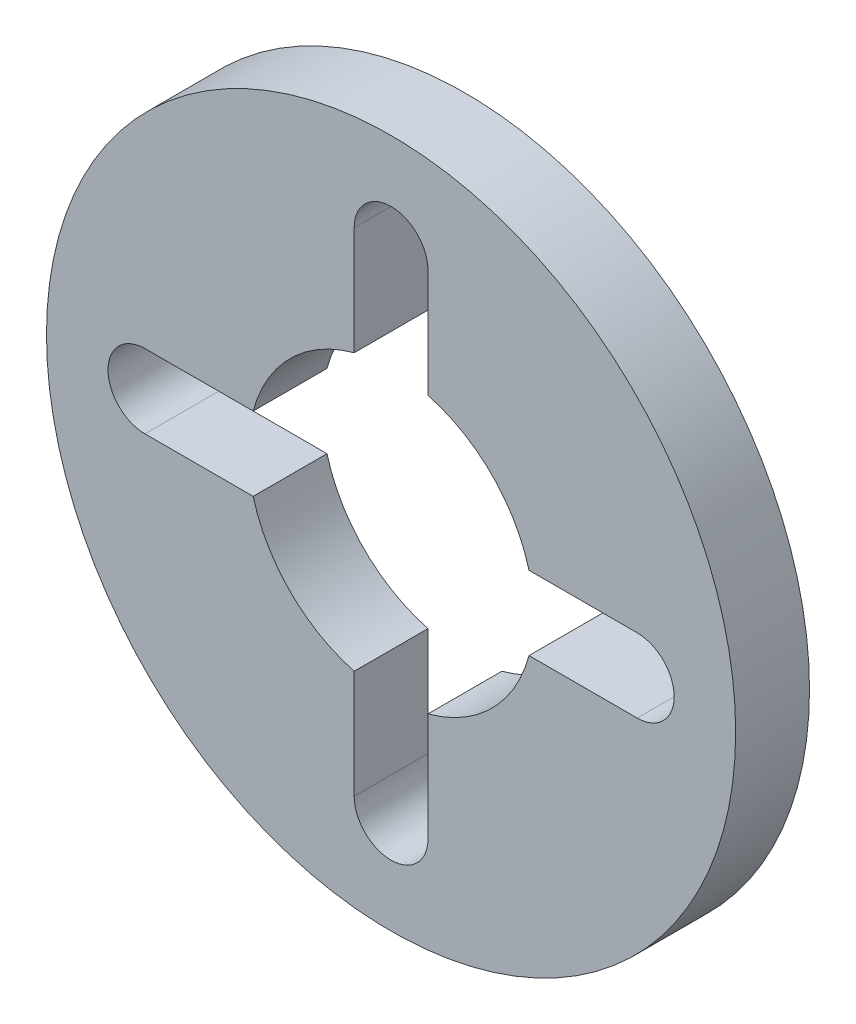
from build123d import *

# Parameters (mm, degrees)
SKETCH_1_R      = 7
EXTRUDE_1_DEPTH = 1.5


with BuildPart() as part:
    # Sketch 1 → Extrude 1 (new body)
    with BuildSketch(Plane.XY):
        Circle(SKETCH_1_R)
        with BuildLine():
            Line((2.801338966, 0.75), (5, 0.75))
            ThreePointArc((5, 0.75), (5.75, 0), (5, -0.75))
            Line((5, -0.75), (2.801338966, -0.75))
            ThreePointArc((2.801338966, -0.75), (2.050609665, -2.050609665), (0.75, -2.801338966))
            Line((0.75, -2.801338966), (0.75, -5))
            ThreePointArc((0.75, -5), (0, -5.75), (-0.75, -5))
            Line((-0.75, -5), (-0.75, -2.801338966))
            ThreePointArc((-0.75, -2.801338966), (-2.050609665, -2.050609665), (-2.801338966, -0.75))
            Line((-2.801338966, -0.75), (-5, -0.75))
            ThreePointArc((-5, -0.75), (-5.75, 0), (-5, 0.75))
            Line((-5, 0.75), (-2.801338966, 0.75))
            ThreePointArc((-2.801338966, 0.75), (-2.050609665, 2.050609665), (-0.75, 2.801338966))
            Line((-0.75, 2.801338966), (-0.75, 5))
            ThreePointArc((-0.75, 5), (0, 5.75), (0.75, 5))
            Line((0.75, 5), (0.75, 2.801338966))
            ThreePointArc((0.75, 2.801338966), (2.050609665, 2.050609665), (2.801338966, 0.75))
        make_face(mode=Mode.SUBTRACT)
    extrude(amount=EXTRUDE_1_DEPTH)


solid = part.part
